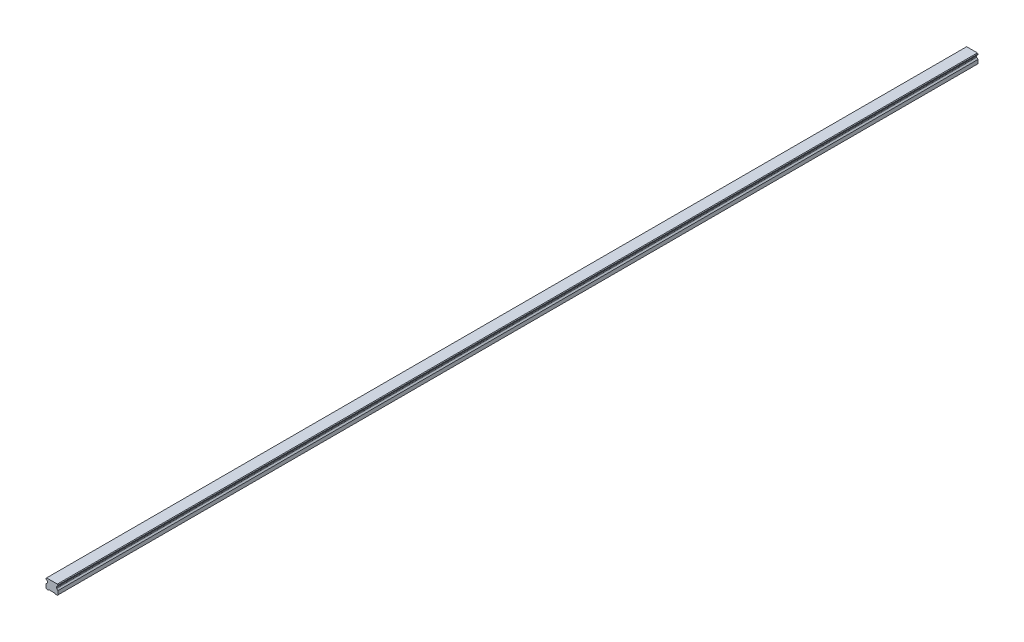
from build123d import *

# Parameters (mm, degrees)
SKETCH1_W           = 20
SKETCH1_H           = 16.3
BOSS_EXTRUDE1_DEPTH = 770
CUT_EXTRUDE1_DEPTH  = 1541.118725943
CHAMFER1_SIZE       = 1
FILLET1_R           = 1
CUT_EXTRUDE2_DEPTH  = 1541.118725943
SKETCH5_R           = 3
SKETCH5_R_2         = 2.5
CUT_EXTRUDE5_DEPTH  = 10
SKETCH5_2_R         = 2.5
CUT_EXTRUDE6_DEPTH  = 13
LPATTERN2_COUNT     = 26
LPATTERN2_PITCH     = 60


with BuildPart() as part:
    # Sketch1 → Boss-Extrude1 (new, symmetric)
    with BuildSketch(Plane.XY):
        with Locations((0, 8.15)):
            Rectangle(SKETCH1_W, SKETCH1_H)
    extrude(amount=BOSS_EXTRUDE1_DEPTH, both=True)

    # Sketch2 → Cut-Extrude1 (cut, through all)
    with BuildSketch(Plane.XY.offset(770)):
        Polygon((-10, 14.3), (-10, 7.3), (-7.666666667, 9.633333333), (-7.666666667, 11.966666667), align=None)
        Polygon((7.666666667, 11.966666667), (10, 14.3), (10, 7.3), (7.666666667, 9.633333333), align=None)
    extrude(amount=-CUT_EXTRUDE1_DEPTH, mode=Mode.SUBTRACT)

    # Chamfer1
    chamfer1_edges = [part.edges().sort_by_distance(p)[0] for p in [
        (-10, 16.3, 0),
        (10, 16.3, 0),
        (10, 0, 0),
        (-10, 0, 0),
    ]]
    chamfer(chamfer1_edges, length=CHAMFER1_SIZE)

    # Fillet1
    fillet1_edges = [part.edges().sort_by_distance(p)[0] for p in [
        (-7.666666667, 11.966666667, 0),
        (-7.666666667, 9.633333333, 0),
        (7.666666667, 9.633333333, 0),
        (7.666666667, 11.966666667, 0),
    ]]
    fillet(fillet1_edges, radius=FILLET1_R)

    # Sketch3 → Cut-Extrude2 (cut, through all)
    with BuildSketch(Plane.XY.offset(770)):
        Polygon((-6, 0), (-5, 1), (5, 1), (6, 0), align=None)
    extrude(amount=-CUT_EXTRUDE2_DEPTH, mode=Mode.SUBTRACT)

    # Sketch5 → Cut-Extrude5 (cut)
    with BuildSketch(Plane.XZ.offset(-1)):
        with Locations(Location((0, 750, 0), (0, 0, 270))):
            Circle(SKETCH5_R)
        with Locations(Location((0, 750, 0), (0, 0, 270))):
            Circle(SKETCH5_R_2, mode=Mode.SUBTRACT)
    cut_extrude5 = extrude(amount=-CUT_EXTRUDE5_DEPTH, mode=Mode.SUBTRACT)

    # Sketch5_2 → Cut-Extrude6 (cut)
    with BuildSketch(Plane.XZ.offset(-1)):
        with Locations(Location((0, 750, 0), (0, 0, 270))):
            Circle(SKETCH5_2_R)
    cut_extrude6 = extrude(amount=-CUT_EXTRUDE6_DEPTH, mode=Mode.SUBTRACT)

    # Cut-Extrude7 cone 1 section (on through the dimple's axis) → Cut-Extrude7 (revolve, cut)
    with BuildSketch(Plane(origin=(0, 14, 750), x_dir=(0, 0, -1), z_dir=(1, 0, 0))):
        Polygon((0, 0), (2.5, 0), (0, 1.443375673), align=None)
    cut_extrude7 = revolve(axis=Axis((0, 14, 750), (0, 1, 0)), mode=Mode.SUBTRACT)

    # LPattern2: Cut-Extrude5, Cut-Extrude6, Cut-Extrude7 ×26
    with Locations(*[(0, 0, -i * LPATTERN2_PITCH) for i in range(1, LPATTERN2_COUNT)]):
        add(cut_extrude5, mode=Mode.SUBTRACT)
        add(cut_extrude6, mode=Mode.SUBTRACT)
        add(cut_extrude7, mode=Mode.SUBTRACT)


solid = part.part
